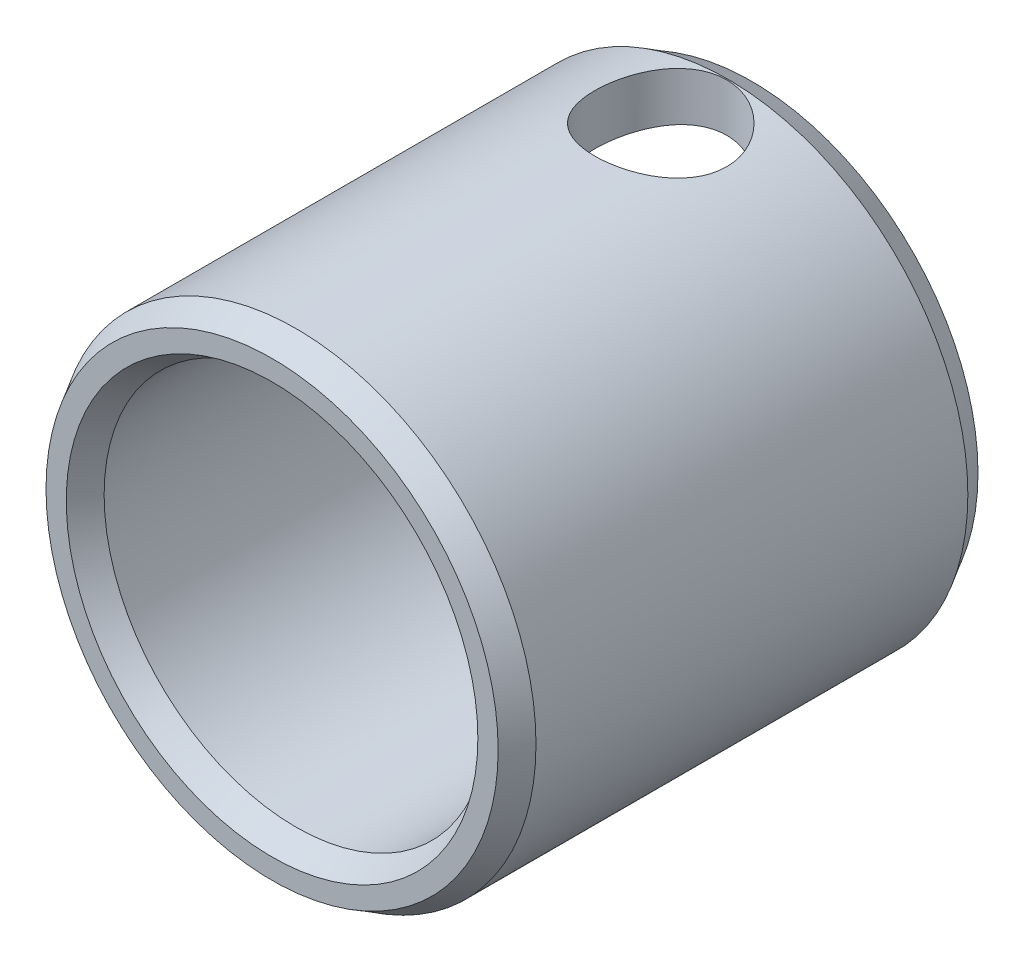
ISO-10303-21;
HEADER;
FILE_DESCRIPTION(('STEP AP214'),'2;1');
FILE_NAME('part.step','',(''),(''),'','','');
FILE_SCHEMA(('AUTOMOTIVE_DESIGN { 1 0 10303 214 1 1 1 1 }'));
ENDSEC;
DATA;
#1=APPLICATION_CONTEXT('core data for automotive mechanical design processes');
#2=APPLICATION_PROTOCOL_DEFINITION('international standard','automotive_design',2000,#1);
#3=PRODUCT_CONTEXT('',#1,'mechanical');
#4=PRODUCT('Part','Part','',(#3));
#5=PRODUCT_RELATED_PRODUCT_CATEGORY('part','',(#4));
#6=PRODUCT_DEFINITION_FORMATION('','',#4);
#7=PRODUCT_DEFINITION_CONTEXT('part definition',#1,'design');
#8=PRODUCT_DEFINITION('design','',#6,#7);
#9=PRODUCT_DEFINITION_SHAPE('','',#8);
#10=(LENGTH_UNIT() NAMED_UNIT(*) SI_UNIT(.MILLI.,.METRE.));
#11=(NAMED_UNIT(*) PLANE_ANGLE_UNIT() SI_UNIT($,.RADIAN.));
#12=(NAMED_UNIT(*) SI_UNIT($,.STERADIAN.) SOLID_ANGLE_UNIT());
#13=UNCERTAINTY_MEASURE_WITH_UNIT(LENGTH_MEASURE(1.E-05),#10,'distance_accuracy_value','');
#14=(GEOMETRIC_REPRESENTATION_CONTEXT(3) GLOBAL_UNCERTAINTY_ASSIGNED_CONTEXT((#13)) GLOBAL_UNIT_ASSIGNED_CONTEXT((#10,
#11,#12)) REPRESENTATION_CONTEXT('',''));
#15=CARTESIAN_POINT('',(0.,0.,0.));
#16=DIRECTION('',(0.,0.,1.));
#17=DIRECTION('',(1.,0.,0.));
#18=AXIS2_PLACEMENT_3D('',#15,#16,#17);
#19=CARTESIAN_POINT('',(0.,0.,22.8719275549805));
#20=DIRECTION('',(0.,0.,1.));
#21=DIRECTION('',(1.,0.,0.));
#22=AXIS2_PLACEMENT_3D('',#19,#20,#21);
#23=CYLINDRICAL_SURFACE('',#22,8.);
#24=CARTESIAN_POINT('',(0.,0.,19.));
#25=DIRECTION('',(0.,0.,1.));
#26=DIRECTION('',(1.,0.,0.));
#27=AXIS2_PLACEMENT_3D('',#24,#25,#26);
#28=CIRCLE('',#27,8.);
#29=CARTESIAN_POINT('',(8.,0.,19.));
#30=VERTEX_POINT('',#29);
#31=EDGE_CURVE('E29',#30,#30,#28,.T.);
#32=ORIENTED_EDGE('',*,*,#31,.T.);
#33=EDGE_LOOP('',(#32));
#34=FACE_BOUND('',#33,.T.);
#35=CARTESIAN_POINT('',(0.,0.,1.));
#36=DIRECTION('',(0.,0.,1.));
#37=DIRECTION('',(1.,0.,0.));
#38=AXIS2_PLACEMENT_3D('',#35,#36,#37);
#39=CIRCLE('',#38,8.);
#40=CARTESIAN_POINT('',(8.,0.,1.));
#41=VERTEX_POINT('',#40);
#42=EDGE_CURVE('E34',#41,#41,#39,.T.);
#43=ORIENTED_EDGE('',*,*,#42,.F.);
#44=EDGE_LOOP('',(#43));
#45=FACE_BOUND('',#44,.T.);
#46=CARTESIAN_POINT('',(0.,8.,6.55));
#47=CARTESIAN_POINT('',(0.149780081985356,8.00000114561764,6.55000168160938));
#48=CARTESIAN_POINT('',(0.299548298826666,7.99575532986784,6.53772375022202));
#49=CARTESIAN_POINT('',(0.594657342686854,7.97923751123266,6.48909818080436));
#50=CARTESIAN_POINT('',(0.739997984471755,7.96696517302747,6.45274953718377));
#51=CARTESIAN_POINT('',(1.02195487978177,7.93572397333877,6.35738694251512));
#52=CARTESIAN_POINT('',(1.15858579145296,7.91676673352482,6.29841231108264));
#53=CARTESIAN_POINT('',(1.42001515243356,7.87407925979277,6.15965491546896));
#54=CARTESIAN_POINT('',(1.54481103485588,7.85034799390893,6.0798676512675));
#55=CARTESIAN_POINT('',(1.78358955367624,7.79962855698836,5.89869068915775));
#56=CARTESIAN_POINT('',(1.89708036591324,7.77255883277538,5.7966757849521));
#57=CARTESIAN_POINT('',(2.10572373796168,7.71865026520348,5.57526791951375));
#58=CARTESIAN_POINT('',(2.20087190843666,7.69181147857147,5.45587081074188));
#59=CARTESIAN_POINT('',(2.37301177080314,7.64049418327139,5.19857016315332));
#60=CARTESIAN_POINT('',(2.44935095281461,7.61611433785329,5.0602084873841));
#61=CARTESIAN_POINT('',(2.57746356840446,7.57372225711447,4.77163733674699));
#62=CARTESIAN_POINT('',(2.62924504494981,7.55570793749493,4.62143175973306));
#63=CARTESIAN_POINT('',(2.70490383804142,7.52894839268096,4.31904863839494));
#64=CARTESIAN_POINT('',(2.72970718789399,7.51989658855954,4.16713075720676));
#65=CARTESIAN_POINT('',(2.75360105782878,7.51118223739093,3.86104057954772));
#66=CARTESIAN_POINT('',(2.75270013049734,7.51151656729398,3.70686904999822));
#67=CARTESIAN_POINT('',(2.72592734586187,7.52126907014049,3.40867679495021));
#68=CARTESIAN_POINT('',(2.70128128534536,7.53024131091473,3.26452885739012));
#69=CARTESIAN_POINT('',(2.62972394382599,7.55552626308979,2.98255457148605));
#70=CARTESIAN_POINT('',(2.58280983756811,7.57183990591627,2.84472902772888));
#71=CARTESIAN_POINT('',(2.46727770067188,7.61027510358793,2.57659659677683));
#72=CARTESIAN_POINT('',(2.39830756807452,7.63248981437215,2.44645535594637));
#73=CARTESIAN_POINT('',(2.24086572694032,7.68018699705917,2.19921373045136));
#74=CARTESIAN_POINT('',(2.15238810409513,7.70567045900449,2.08211731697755));
#75=CARTESIAN_POINT('',(1.95262263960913,7.75876990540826,1.85742470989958));
#76=CARTESIAN_POINT('',(1.84033811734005,7.78642557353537,1.75072210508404));
#77=CARTESIAN_POINT('',(1.59913248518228,7.83951574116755,1.55742025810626));
#78=CARTESIAN_POINT('',(1.47020957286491,7.86494999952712,1.4708231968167));
#79=CARTESIAN_POINT('',(1.19740022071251,7.91110336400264,1.31940958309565));
#80=CARTESIAN_POINT('',(1.05336314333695,7.93176681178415,1.25484630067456));
#81=CARTESIAN_POINT('',(0.755590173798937,7.96564454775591,1.15114870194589));
#82=CARTESIAN_POINT('',(0.601857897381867,7.97886159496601,1.11200496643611));
#83=CARTESIAN_POINT('',(0.296612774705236,7.99589351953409,1.06187280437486));
#84=CARTESIAN_POINT('',(0.145320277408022,8.00011096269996,1.04967796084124));
#85=CARTESIAN_POINT('',(-0.157188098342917,7.99988463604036,1.05033484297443));
#86=CARTESIAN_POINT('',(-0.308403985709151,7.99544243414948,1.06318203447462));
#87=CARTESIAN_POINT('',(-0.601546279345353,7.9786619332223,1.11261186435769));
#88=CARTESIAN_POINT('',(-0.743615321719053,7.96657409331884,1.1484421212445));
#89=CARTESIAN_POINT('',(-1.0196587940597,7.93596860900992,1.24186840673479));
#90=CARTESIAN_POINT('',(-1.15363217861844,7.91745013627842,1.29946723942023));
#91=CARTESIAN_POINT('',(-1.41374527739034,7.87522494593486,1.43652322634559));
#92=CARTESIAN_POINT('',(-1.53957309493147,7.85139089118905,1.51653194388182));
#93=CARTESIAN_POINT('',(-1.77640230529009,7.80122253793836,1.69549504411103));
#94=CARTESIAN_POINT('',(-1.88739890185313,7.77488743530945,1.79445553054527));
#95=CARTESIAN_POINT('',(-2.0970213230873,7.72106116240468,2.01417974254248));
#96=CARTESIAN_POINT('',(-2.19478672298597,7.69357583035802,2.1357678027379));
#97=CARTESIAN_POINT('',(-2.36864796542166,7.64184277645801,2.39420551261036));
#98=CARTESIAN_POINT('',(-2.44474328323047,7.61759513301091,2.53105553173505));
#99=CARTESIAN_POINT('',(-2.57283393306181,7.57529527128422,2.81640836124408));
#100=CARTESIAN_POINT('',(-2.62484877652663,7.55723804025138,2.9649016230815));
#101=CARTESIAN_POINT('',(-2.70287369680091,7.52968918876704,3.26931169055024));
#102=CARTESIAN_POINT('',(-2.72889648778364,7.52019338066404,3.42522482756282));
#103=CARTESIAN_POINT('',(-2.75316931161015,7.51133867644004,3.73089753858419));
#104=CARTESIAN_POINT('',(-2.75285658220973,7.51145518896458,3.88052898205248));
#105=CARTESIAN_POINT('',(-2.72803949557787,7.52050337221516,4.17748650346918));
#106=CARTESIAN_POINT('',(-2.70353675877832,7.52943445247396,4.32481273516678));
#107=CARTESIAN_POINT('',(-2.6320790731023,7.55470309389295,4.60980828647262));
#108=CARTESIAN_POINT('',(-2.58561819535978,7.57087727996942,4.74761713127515));
#109=CARTESIAN_POINT('',(-2.47197076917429,7.60874043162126,5.01358481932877));
#110=CARTESIAN_POINT('',(-2.40477944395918,7.63043066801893,5.1417414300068));
#111=CARTESIAN_POINT('',(-2.24798578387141,7.67812208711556,5.39114441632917));
#112=CARTESIAN_POINT('',(-2.15749666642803,7.70427539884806,5.51180398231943));
#113=CARTESIAN_POINT('',(-1.95814409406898,7.75733839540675,5.73668901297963));
#114=CARTESIAN_POINT('',(-1.84927529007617,7.78424829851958,5.84090967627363));
#115=CARTESIAN_POINT('',(-1.61071163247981,7.83716373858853,6.03443011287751));
#116=CARTESIAN_POINT('',(-1.48032902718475,7.8630824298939,6.12290895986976));
#117=CARTESIAN_POINT('',(-1.20567117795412,7.90985017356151,6.27661215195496));
#118=CARTESIAN_POINT('',(-1.06139844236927,7.9307001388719,6.34184068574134));
#119=CARTESIAN_POINT('',(-0.76652952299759,7.96454106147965,6.44551834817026));
#120=CARTESIAN_POINT('',(-0.616164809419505,7.97770686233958,6.48456653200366));
#121=CARTESIAN_POINT('',(-0.310528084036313,7.99543435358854,6.53680232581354));
#122=CARTESIAN_POINT('',(-0.155257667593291,7.99999881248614,6.54999825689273));
#123=CARTESIAN_POINT('',(0.,8.,6.55));
#124=B_SPLINE_CURVE_WITH_KNOTS('',3,(#46,#47,#48,#49,#50,#51,#52,#53,#54,#55,#56,#57,#58,#59,
#60,#61,#62,#63,#64,#65,#66,#67,#68,#69,#70,#71,#72,#73,#74,#75,#76,#77,#78,#79,#80,#81,#82,#83,
#84,#85,#86,#87,#88,#89,#90,#91,#92,#93,#94,#95,#96,#97,#98,#99,#100,#101,#102,#103,#104,#105,
#106,#107,#108,#109,#110,#111,#112,#113,#114,#115,#116,#117,#118,#119,#120,#121,#122,#123),
.UNSPECIFIED.,.T.,.F.,(4,2,2,2,2,2,2,2,2,2,2,2,2,2,2,2,2,2,2,2,2,2,2,2,2,2,2,2,2,2,2,2,2,2,2,2,
2,2,4),(0.,0.448768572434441,0.897555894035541,1.34556681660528,1.79367468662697,
2.25654857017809,2.71953308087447,3.19683587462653,3.67398223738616,4.13417625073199,
4.59421714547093,5.0317149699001,5.46926831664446,5.91418814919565,6.35924305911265,
6.8291099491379,7.29902778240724,7.77417829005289,8.24915263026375,8.70239221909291,
9.15554975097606,9.59458114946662,10.033669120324,10.484691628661,10.9358596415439,
11.4088966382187,11.8819450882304,12.3546095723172,12.827042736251,13.2737109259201,
13.7203491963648,14.1573843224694,14.5945202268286,15.051711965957,15.5090369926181,
15.9857702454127,16.4624175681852,16.9277477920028,17.3929282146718),.UNSPECIFIED.);
#125=CARTESIAN_POINT('',(0.,8.,6.55));
#126=VERTEX_POINT('',#125);
#127=EDGE_CURVE('E49',#126,#126,#124,.T.);
#128=ORIENTED_EDGE('',*,*,#127,.T.);
#129=EDGE_LOOP('',(#128));
#130=FACE_BOUND('',#129,.T.);
#131=ADVANCED_FACE('F12',(#34,#45,#130),#23,.F.);
#132=CARTESIAN_POINT('',(0.,0.,22.8719275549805));
#133=DIRECTION('',(0.,0.,1.));
#134=DIRECTION('',(1.,0.,0.));
#135=AXIS2_PLACEMENT_3D('',#132,#133,#134);
#136=CYLINDRICAL_SURFACE('',#135,10.);
#137=CARTESIAN_POINT('',(0.,0.,19.));
#138=DIRECTION('',(0.,0.,1.));
#139=DIRECTION('',(1.,0.,0.));
#140=AXIS2_PLACEMENT_3D('',#137,#138,#139);
#141=CIRCLE('',#140,10.);
#142=CARTESIAN_POINT('',(10.,0.,19.));
#143=VERTEX_POINT('',#142);
#144=EDGE_CURVE('E46',#143,#143,#141,.T.);
#145=ORIENTED_EDGE('',*,*,#144,.F.);
#146=EDGE_LOOP('',(#145));
#147=FACE_BOUND('',#146,.T.);
#148=CARTESIAN_POINT('',(0.,0.,1.));
#149=DIRECTION('',(0.,0.,1.));
#150=DIRECTION('',(1.,0.,0.));
#151=AXIS2_PLACEMENT_3D('',#148,#149,#150);
#152=CIRCLE('',#151,10.);
#153=CARTESIAN_POINT('',(10.,0.,1.));
#154=VERTEX_POINT('',#153);
#155=EDGE_CURVE('E43',#154,#154,#152,.T.);
#156=ORIENTED_EDGE('',*,*,#155,.T.);
#157=EDGE_LOOP('',(#156));
#158=FACE_BOUND('',#157,.T.);
#159=CARTESIAN_POINT('',(0.,10.,6.55));
#160=CARTESIAN_POINT('',(-0.15142288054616,9.99999790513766,6.54999678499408));
#161=CARTESIAN_POINT('',(-0.302879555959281,9.99652704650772,6.53745149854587));
#162=CARTESIAN_POINT('',(-0.60141835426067,9.9830186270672,6.48769783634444));
#163=CARTESIAN_POINT('',(-0.748498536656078,9.97297819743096,6.45047868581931));
#164=CARTESIAN_POINT('',(-1.03393279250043,9.94743692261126,6.35268752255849));
#165=CARTESIAN_POINT('',(-1.17229822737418,9.93194336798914,6.29214667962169));
#166=CARTESIAN_POINT('',(-1.43691255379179,9.89712668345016,6.14954921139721));
#167=CARTESIAN_POINT('',(-1.56316043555,9.87780323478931,6.06749079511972));
#168=CARTESIAN_POINT('',(-1.80305227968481,9.83687707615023,5.882063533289));
#169=CARTESIAN_POINT('',(-1.91635675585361,9.81523348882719,5.77826450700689));
#170=CARTESIAN_POINT('',(-2.12418937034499,9.77236429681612,5.55322139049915));
#171=CARTESIAN_POINT('',(-2.21871492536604,9.75113874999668,5.43197490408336));
#172=CARTESIAN_POINT('',(-2.3879928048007,9.71108741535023,5.1727300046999));
#173=CARTESIAN_POINT('',(-2.46234890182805,9.69231302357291,5.03446419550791));
#174=CARTESIAN_POINT('',(-2.58662289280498,9.65989315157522,4.7467931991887));
#175=CARTESIAN_POINT('',(-2.63654561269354,9.64624665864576,4.597390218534));
#176=CARTESIAN_POINT('',(-2.70934583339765,9.62605068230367,4.29545889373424));
#177=CARTESIAN_POINT('',(-2.73284141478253,9.61933931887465,4.14309067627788));
#178=CARTESIAN_POINT('',(-2.75404817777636,9.61329031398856,3.83643877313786));
#179=CARTESIAN_POINT('',(-2.7517645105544,9.61395119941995,3.68215547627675));
#180=CARTESIAN_POINT('',(-2.72196703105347,9.62242747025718,3.38092425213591));
#181=CARTESIAN_POINT('',(-2.69520726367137,9.63002901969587,3.23389475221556));
#182=CARTESIAN_POINT('',(-2.61842742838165,9.6511868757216,2.9464974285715));
#183=CARTESIAN_POINT('',(-2.56840539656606,9.66474368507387,2.80613016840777));
#184=CARTESIAN_POINT('',(-2.4459209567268,9.6964683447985,2.53410558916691));
#185=CARTESIAN_POINT('',(-2.37319900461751,9.71468906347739,2.40257156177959));
#186=CARTESIAN_POINT('',(-2.20755990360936,9.75366083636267,2.15331151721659));
#187=CARTESIAN_POINT('',(-2.11463855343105,9.77441241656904,2.03558838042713));
#188=CARTESIAN_POINT('',(-1.90740929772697,9.81699239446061,1.81299085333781));
#189=CARTESIAN_POINT('',(-1.79246989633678,9.83883313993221,1.70870584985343));
#190=CARTESIAN_POINT('',(-1.54646529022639,9.88048509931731,1.5207665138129));
#191=CARTESIAN_POINT('',(-1.41539936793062,9.90029622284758,1.43711309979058));
#192=CARTESIAN_POINT('',(-1.13991171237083,9.93579173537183,1.29252903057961));
#193=CARTESIAN_POINT('',(-0.995428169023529,9.95145560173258,1.23171077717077));
#194=CARTESIAN_POINT('',(-0.697756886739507,9.97674362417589,1.13540050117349));
#195=CARTESIAN_POINT('',(-0.544571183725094,9.98636918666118,1.09990258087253));
#196=CARTESIAN_POINT('',(-0.238869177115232,9.99828101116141,1.05617934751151));
#197=CARTESIAN_POINT('',(-0.0864756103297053,10.0007826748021,1.04715335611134));
#198=CARTESIAN_POINT('',(0.217649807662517,9.9987871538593,1.05441110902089));
#199=CARTESIAN_POINT('',(0.369381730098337,9.99429074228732,1.07069205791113));
#200=CARTESIAN_POINT('',(0.664979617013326,9.97894393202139,1.12744676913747));
#201=CARTESIAN_POINT('',(0.808939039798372,9.9682122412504,1.16746883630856));
#202=CARTESIAN_POINT('',(1.0880827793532,9.94161719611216,1.27004065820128));
#203=CARTESIAN_POINT('',(1.22326611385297,9.92575326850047,1.33259292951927));
#204=CARTESIAN_POINT('',(1.48409215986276,9.89015496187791,1.47990036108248));
#205=CARTESIAN_POINT('',(1.60948250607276,9.8703479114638,1.56508435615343));
#206=CARTESIAN_POINT('',(1.84446827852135,9.82915015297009,1.75470256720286));
#207=CARTESIAN_POINT('',(1.95406037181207,9.80775911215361,1.85914083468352));
#208=CARTESIAN_POINT('',(2.15775026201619,9.7650031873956,2.08804742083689));
#209=CARTESIAN_POINT('',(2.25128173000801,9.74365851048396,2.21302443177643));
#210=CARTESIAN_POINT('',(2.41606367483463,9.70411480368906,2.47735585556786));
#211=CARTESIAN_POINT('',(2.48731502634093,9.68591565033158,2.61670970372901));
#212=CARTESIAN_POINT('',(2.60498194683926,9.65493519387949,2.9051872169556));
#213=CARTESIAN_POINT('',(2.65153712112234,9.64212352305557,3.05425049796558));
#214=CARTESIAN_POINT('',(2.71879365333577,9.62337795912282,3.35850589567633));
#215=CARTESIAN_POINT('',(2.73950213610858,9.61744217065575,3.51369631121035));
#216=CARTESIAN_POINT('',(2.75404886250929,9.6132857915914,3.81998313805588));
#217=CARTESIAN_POINT('',(2.7488002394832,9.614803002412,3.97103325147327));
#218=CARTESIAN_POINT('',(2.71371466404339,9.62476380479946,4.27000569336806));
#219=CARTESIAN_POINT('',(2.68387842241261,9.63320719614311,4.41792811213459));
#220=CARTESIAN_POINT('',(2.60100915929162,9.65590796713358,4.70521496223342));
#221=CARTESIAN_POINT('',(2.54818121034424,9.67011387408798,4.84464290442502));
#222=CARTESIAN_POINT('',(2.4209868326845,9.70273746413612,5.11276434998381));
#223=CARTESIAN_POINT('',(2.34661683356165,9.72115584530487,5.24145606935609));
#224=CARTESIAN_POINT('',(2.17573113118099,9.76084545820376,5.48878195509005));
#225=CARTESIAN_POINT('',(2.07859788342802,9.78218767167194,5.60697809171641));
#226=CARTESIAN_POINT('',(1.86610223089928,9.82493707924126,5.82568951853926));
#227=CARTESIAN_POINT('',(1.75073533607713,9.84634428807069,5.92620044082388));
#228=CARTESIAN_POINT('',(1.50182041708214,9.88740569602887,6.10898765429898));
#229=CARTESIAN_POINT('',(1.36791284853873,9.907007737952,6.19078709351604));
#230=CARTESIAN_POINT('',(1.08770978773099,9.94166772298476,6.33058644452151));
#231=CARTESIAN_POINT('',(0.941421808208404,9.95672839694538,6.38860066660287));
#232=CARTESIAN_POINT('',(0.663199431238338,9.97880995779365,6.4721727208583));
#233=CARTESIAN_POINT('',(0.532391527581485,9.9866965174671,6.50128757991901));
#234=CARTESIAN_POINT('',(0.2677309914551,9.9972921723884,6.54020155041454));
#235=CARTESIAN_POINT('',(0.13387870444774,10.0000018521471,6.55000284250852));
#236=CARTESIAN_POINT('',(0.,10.,6.55));
#237=B_SPLINE_CURVE_WITH_KNOTS('',3,(#159,#160,#161,#162,#163,#164,#165,#166,#167,#168,#169,
#170,#171,#172,#173,#174,#175,#176,#177,#178,#179,#180,#181,#182,#183,#184,#185,#186,#187,#188,
#189,#190,#191,#192,#193,#194,#195,#196,#197,#198,#199,#200,#201,#202,#203,#204,#205,#206,#207,
#208,#209,#210,#211,#212,#213,#214,#215,#216,#217,#218,#219,#220,#221,#222,#223,#224,#225,#226,
#227,#228,#229,#230,#231,#232,#233,#234,#235,#236),.UNSPECIFIED.,.T.,.F.,(4,2,2,2,2,2,2,2,2,2,2,
2,2,2,2,2,2,2,2,2,2,2,2,2,2,2,2,2,2,2,2,2,2,2,2,2,2,2,4),(0.,0.45377748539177,0.907753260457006,
1.36112438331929,1.81453325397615,2.27794447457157,2.74141939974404,3.21343018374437,
3.68534770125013,4.14598225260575,4.60652476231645,5.0533402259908,5.50019341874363,
5.95235548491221,6.40461168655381,6.87259959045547,7.34060832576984,7.81089145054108,
8.28106499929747,8.73686293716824,9.19261053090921,9.63995333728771,10.0873461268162,
10.5439096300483,11.0005693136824,11.4709880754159,11.9413883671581,12.4091004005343,
12.8766834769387,13.3279371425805,13.7791777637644,14.2264735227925,14.6738434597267,
15.1351456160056,15.5965615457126,16.0686764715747,16.5405069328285,16.9417541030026,
17.3429559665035),.UNSPECIFIED.);
#238=CARTESIAN_POINT('',(0.,10.,6.55));
#239=VERTEX_POINT('',#238);
#240=EDGE_CURVE('E16',#239,#239,#237,.T.);
#241=ORIENTED_EDGE('',*,*,#240,.T.);
#242=EDGE_LOOP('',(#241));
#243=FACE_BOUND('',#242,.T.);
#244=ADVANCED_FACE('F63',(#147,#158,#243),#136,.T.);
#245=CARTESIAN_POINT('',(0.,0.,19.));
#246=DIRECTION('',(0.,0.,-1.));
#247=DIRECTION('',(-1.,0.,0.));
#248=AXIS2_PLACEMENT_3D('',#245,#246,#247);
#249=CONICAL_SURFACE('',#248,10.,0.523598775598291);
#250=CARTESIAN_POINT('',(0.,0.,20.));
#251=DIRECTION('',(0.,0.,1.));
#252=DIRECTION('',(1.,0.,0.));
#253=AXIS2_PLACEMENT_3D('',#250,#251,#252);
#254=CIRCLE('',#253,9.42264973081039);
#255=CARTESIAN_POINT('',(9.42264973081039,0.,20.));
#256=VERTEX_POINT('',#255);
#257=EDGE_CURVE('E8',#256,#256,#254,.T.);
#258=ORIENTED_EDGE('',*,*,#257,.F.);
#259=EDGE_LOOP('',(#258));
#260=FACE_BOUND('',#259,.T.);
#261=ORIENTED_EDGE('',*,*,#144,.T.);
#262=EDGE_LOOP('',(#261));
#263=FACE_BOUND('',#262,.T.);
#264=ADVANCED_FACE('F14',(#260,#263),#249,.T.);
#265=CARTESIAN_POINT('',(0.,-8.5773502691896,20.));
#266=DIRECTION('',(0.,0.,1.));
#267=DIRECTION('',(1.,0.,0.));
#268=AXIS2_PLACEMENT_3D('',#265,#266,#267);
#269=PLANE('',#268);
#270=ORIENTED_EDGE('',*,*,#257,.T.);
#271=EDGE_LOOP('',(#270));
#272=FACE_BOUND('',#271,.T.);
#273=CARTESIAN_POINT('',(0.,0.,20.));
#274=DIRECTION('',(0.,0.,1.));
#275=DIRECTION('',(1.,0.,0.));
#276=AXIS2_PLACEMENT_3D('',#273,#274,#275);
#277=CIRCLE('',#276,8.57735026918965);
#278=CARTESIAN_POINT('',(8.57735026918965,0.,20.));
#279=VERTEX_POINT('',#278);
#280=EDGE_CURVE('E25',#279,#279,#277,.T.);
#281=ORIENTED_EDGE('',*,*,#280,.F.);
#282=EDGE_LOOP('',(#281));
#283=FACE_BOUND('',#282,.T.);
#284=ADVANCED_FACE('F84',(#272,#283),#269,.T.);
#285=CARTESIAN_POINT('',(0.,0.,19.));
#286=DIRECTION('',(0.,0.,1.));
#287=DIRECTION('',(1.,0.,0.));
#288=AXIS2_PLACEMENT_3D('',#285,#286,#287);
#289=CONICAL_SURFACE('',#288,8.,0.523598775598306);
#290=ORIENTED_EDGE('',*,*,#280,.T.);
#291=EDGE_LOOP('',(#290));
#292=FACE_BOUND('',#291,.T.);
#293=ORIENTED_EDGE('',*,*,#31,.F.);
#294=EDGE_LOOP('',(#293));
#295=FACE_BOUND('',#294,.T.);
#296=ADVANCED_FACE('F77',(#292,#295),#289,.F.);
#297=CARTESIAN_POINT('',(0.,0.,1.));
#298=DIRECTION('',(0.,0.,-1.));
#299=DIRECTION('',(-1.,0.,0.));
#300=AXIS2_PLACEMENT_3D('',#297,#298,#299);
#301=CONICAL_SURFACE('',#300,8.,0.523598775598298);
#302=CARTESIAN_POINT('',(0.,0.,0.));
#303=DIRECTION('',(0.,0.,1.));
#304=DIRECTION('',(1.,0.,0.));
#305=AXIS2_PLACEMENT_3D('',#302,#303,#304);
#306=CIRCLE('',#305,8.57735026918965);
#307=CARTESIAN_POINT('',(8.57735026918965,0.,0.));
#308=VERTEX_POINT('',#307);
#309=EDGE_CURVE('E37',#308,#308,#306,.T.);
#310=ORIENTED_EDGE('',*,*,#309,.F.);
#311=EDGE_LOOP('',(#310));
#312=FACE_BOUND('',#311,.T.);
#313=ORIENTED_EDGE('',*,*,#42,.T.);
#314=EDGE_LOOP('',(#313));
#315=FACE_BOUND('',#314,.T.);
#316=ADVANCED_FACE('F74',(#312,#315),#301,.F.);
#317=CARTESIAN_POINT('',(0.,-9.42264973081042,0.));
#318=DIRECTION('',(0.,0.,-1.));
#319=DIRECTION('',(-1.,0.,0.));
#320=AXIS2_PLACEMENT_3D('',#317,#318,#319);
#321=PLANE('',#320);
#322=ORIENTED_EDGE('',*,*,#309,.T.);
#323=EDGE_LOOP('',(#322));
#324=FACE_BOUND('',#323,.T.);
#325=CARTESIAN_POINT('',(0.,0.,0.));
#326=DIRECTION('',(0.,0.,1.));
#327=DIRECTION('',(1.,0.,0.));
#328=AXIS2_PLACEMENT_3D('',#325,#326,#327);
#329=CIRCLE('',#328,9.42264973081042);
#330=CARTESIAN_POINT('',(9.42264973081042,0.,0.));
#331=VERTEX_POINT('',#330);
#332=EDGE_CURVE('E40',#331,#331,#329,.T.);
#333=ORIENTED_EDGE('',*,*,#332,.F.);
#334=EDGE_LOOP('',(#333));
#335=FACE_BOUND('',#334,.T.);
#336=ADVANCED_FACE('F71',(#324,#335),#321,.T.);
#337=CARTESIAN_POINT('',(0.,0.,1.));
#338=DIRECTION('',(0.,0.,1.));
#339=DIRECTION('',(1.,0.,0.));
#340=AXIS2_PLACEMENT_3D('',#337,#338,#339);
#341=CONICAL_SURFACE('',#340,10.,0.523598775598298);
#342=ORIENTED_EDGE('',*,*,#332,.T.);
#343=EDGE_LOOP('',(#342));
#344=FACE_BOUND('',#343,.T.);
#345=ORIENTED_EDGE('',*,*,#155,.F.);
#346=EDGE_LOOP('',(#345));
#347=FACE_BOUND('',#346,.T.);
#348=ADVANCED_FACE('F61',(#344,#347),#341,.T.);
#349=CARTESIAN_POINT('',(0.,15.,3.8));
#350=DIRECTION('',(0.,-1.,0.));
#351=DIRECTION('',(0.,0.,1.));
#352=AXIS2_PLACEMENT_3D('',#349,#350,#351);
#353=CYLINDRICAL_SURFACE('',#352,2.75);
#354=ORIENTED_EDGE('',*,*,#127,.F.);
#355=EDGE_LOOP('',(#354));
#356=FACE_BOUND('',#355,.T.);
#357=ORIENTED_EDGE('',*,*,#240,.F.);
#358=EDGE_LOOP('',(#357));
#359=FACE_BOUND('',#358,.T.);
#360=ADVANCED_FACE('F58',(#356,#359),#353,.F.);
#361=CLOSED_SHELL('',(#131,#244,#264,#284,#296,#316,#336,#348,#360));
#362=MANIFOLD_SOLID_BREP('B1',#361);
#363=ADVANCED_BREP_SHAPE_REPRESENTATION('',(#18,#362),#14);
#364=SHAPE_DEFINITION_REPRESENTATION(#9,#363);
ENDSEC;
END-ISO-10303-21;
